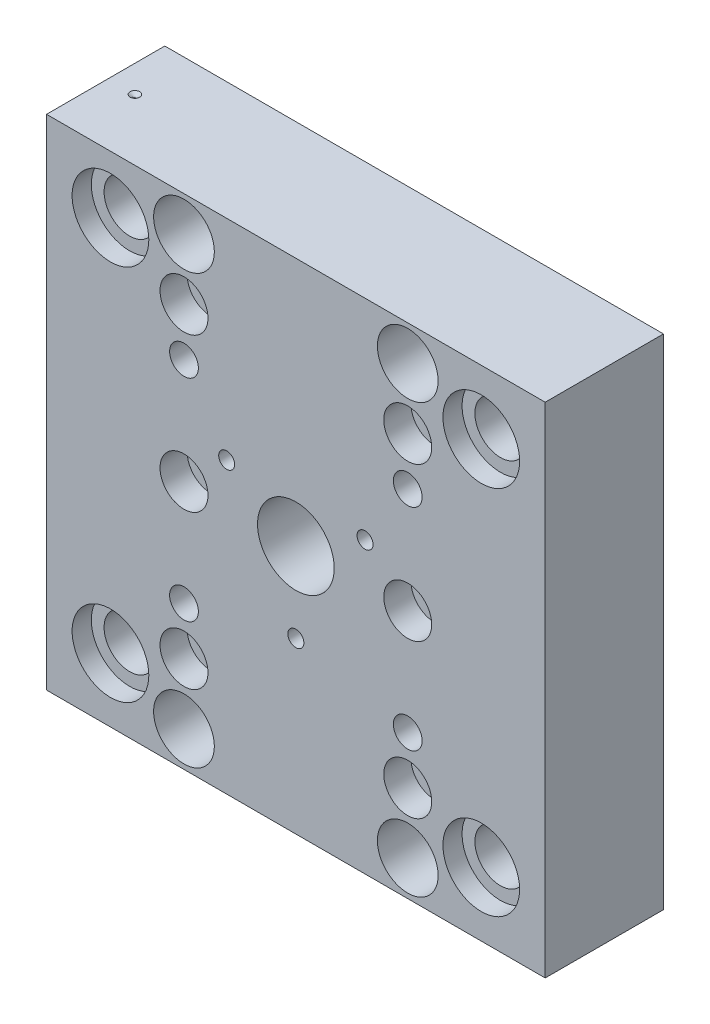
ISO-10303-21;
HEADER;
FILE_DESCRIPTION(('STEP AP214'),'2;1');
FILE_NAME('part.step','',(''),(''),'','','');
FILE_SCHEMA(('AUTOMOTIVE_DESIGN { 1 0 10303 214 1 1 1 1 }'));
ENDSEC;
DATA;
#1=APPLICATION_CONTEXT('core data for automotive mechanical design processes');
#2=APPLICATION_PROTOCOL_DEFINITION('international standard','automotive_design',2000,#1);
#3=PRODUCT_CONTEXT('',#1,'mechanical');
#4=PRODUCT('Part','Part','',(#3));
#5=PRODUCT_RELATED_PRODUCT_CATEGORY('part','',(#4));
#6=PRODUCT_DEFINITION_FORMATION('','',#4);
#7=PRODUCT_DEFINITION_CONTEXT('part definition',#1,'design');
#8=PRODUCT_DEFINITION('design','',#6,#7);
#9=PRODUCT_DEFINITION_SHAPE('','',#8);
#10=(LENGTH_UNIT() NAMED_UNIT(*) SI_UNIT(.MILLI.,.METRE.));
#11=(NAMED_UNIT(*) PLANE_ANGLE_UNIT() SI_UNIT($,.RADIAN.));
#12=(NAMED_UNIT(*) SI_UNIT($,.STERADIAN.) SOLID_ANGLE_UNIT());
#13=UNCERTAINTY_MEASURE_WITH_UNIT(LENGTH_MEASURE(1.E-05),#10,'distance_accuracy_value','');
#14=(GEOMETRIC_REPRESENTATION_CONTEXT(3) GLOBAL_UNCERTAINTY_ASSIGNED_CONTEXT((#13)) GLOBAL_UNIT_ASSIGNED_CONTEXT((#10,
#11,#12)) REPRESENTATION_CONTEXT('',''));
#15=CARTESIAN_POINT('',(0.,0.,0.));
#16=DIRECTION('',(0.,0.,1.));
#17=DIRECTION('',(1.,0.,0.));
#18=AXIS2_PLACEMENT_3D('',#15,#16,#17);
#19=CARTESIAN_POINT('',(-78.,-78.,37.));
#20=DIRECTION('',(0.,0.,1.));
#21=DIRECTION('',(1.,0.,0.));
#22=AXIS2_PLACEMENT_3D('',#19,#20,#21);
#23=PLANE('',#22);
#24=CARTESIAN_POINT('',(21.6506350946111,12.4999999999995,37.));
#25=DIRECTION('',(0.,0.,1.));
#26=DIRECTION('',(1.,0.,0.));
#27=AXIS2_PLACEMENT_3D('',#24,#25,#26);
#28=CIRCLE('',#27,2.5);
#29=CARTESIAN_POINT('',(24.1506350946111,12.4999999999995,37.));
#30=VERTEX_POINT('',#29);
#31=EDGE_CURVE('E106',#30,#30,#28,.T.);
#32=ORIENTED_EDGE('',*,*,#31,.F.);
#33=EDGE_LOOP('',(#32));
#34=FACE_BOUND('',#33,.T.);
#35=CARTESIAN_POINT('',(0.,-25.0000000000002,37.));
#36=DIRECTION('',(0.,0.,1.));
#37=DIRECTION('',(1.,0.,0.));
#38=AXIS2_PLACEMENT_3D('',#35,#36,#37);
#39=CIRCLE('',#38,2.5);
#40=CARTESIAN_POINT('',(2.50000000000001,-25.0000000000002,37.));
#41=VERTEX_POINT('',#40);
#42=EDGE_CURVE('E112',#41,#41,#39,.T.);
#43=ORIENTED_EDGE('',*,*,#42,.F.);
#44=EDGE_LOOP('',(#43));
#45=FACE_BOUND('',#44,.T.);
#46=CARTESIAN_POINT('',(-21.6506350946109,12.4999999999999,37.));
#47=DIRECTION('',(0.,0.,1.));
#48=DIRECTION('',(1.,0.,0.));
#49=AXIS2_PLACEMENT_3D('',#46,#47,#48);
#50=CIRCLE('',#49,2.5);
#51=CARTESIAN_POINT('',(-19.1506350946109,12.4999999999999,37.));
#52=VERTEX_POINT('',#51);
#53=EDGE_CURVE('E118',#52,#52,#50,.T.);
#54=ORIENTED_EDGE('',*,*,#53,.F.);
#55=EDGE_LOOP('',(#54));
#56=FACE_BOUND('',#55,.T.);
#57=CARTESIAN_POINT('',(-35.,-67.,37.));
#58=DIRECTION('',(0.,0.,1.));
#59=DIRECTION('',(1.,0.,0.));
#60=AXIS2_PLACEMENT_3D('',#57,#58,#59);
#61=CIRCLE('',#60,9.5);
#62=CARTESIAN_POINT('',(-25.5,-67.,37.));
#63=VERTEX_POINT('',#62);
#64=EDGE_CURVE('E269',#63,#63,#61,.T.);
#65=ORIENTED_EDGE('',*,*,#64,.F.);
#66=EDGE_LOOP('',(#65));
#67=FACE_BOUND('',#66,.T.);
#68=CARTESIAN_POINT('',(35.,67.,37.));
#69=DIRECTION('',(0.,0.,1.));
#70=DIRECTION('',(1.,0.,0.));
#71=AXIS2_PLACEMENT_3D('',#68,#69,#70);
#72=CIRCLE('',#71,9.5);
#73=CARTESIAN_POINT('',(44.5,67.,37.));
#74=VERTEX_POINT('',#73);
#75=EDGE_CURVE('E281',#74,#74,#72,.T.);
#76=ORIENTED_EDGE('',*,*,#75,.F.);
#77=EDGE_LOOP('',(#76));
#78=FACE_BOUND('',#77,.T.);
#79=DIRECTION('',(0.,-1.,0.));
#80=VECTOR('',#79,1.);
#81=CARTESIAN_POINT('',(-78.,78.,37.));
#82=LINE('',#81,#80);
#83=CARTESIAN_POINT('',(-78.,78.,37.));
#84=VERTEX_POINT('',#83);
#85=CARTESIAN_POINT('',(-78.,-78.,37.));
#86=VERTEX_POINT('',#85);
#87=EDGE_CURVE('E299',#84,#86,#82,.T.);
#88=ORIENTED_EDGE('',*,*,#87,.T.);
#89=DIRECTION('',(1.,0.,0.));
#90=VECTOR('',#89,1.);
#91=CARTESIAN_POINT('',(-78.,-78.,37.));
#92=LINE('',#91,#90);
#93=CARTESIAN_POINT('',(78.,-78.,37.));
#94=VERTEX_POINT('',#93);
#95=EDGE_CURVE('E301',#86,#94,#92,.T.);
#96=ORIENTED_EDGE('',*,*,#95,.T.);
#97=DIRECTION('',(0.,1.,0.));
#98=VECTOR('',#97,1.);
#99=CARTESIAN_POINT('',(78.,-78.,37.));
#100=LINE('',#99,#98);
#101=CARTESIAN_POINT('',(78.,78.,37.));
#102=VERTEX_POINT('',#101);
#103=EDGE_CURVE('E58',#94,#102,#100,.T.);
#104=ORIENTED_EDGE('',*,*,#103,.T.);
#105=DIRECTION('',(-1.,0.,0.));
#106=VECTOR('',#105,1.);
#107=CARTESIAN_POINT('',(78.,78.,37.));
#108=LINE('',#107,#106);
#109=EDGE_CURVE('E53',#102,#84,#108,.T.);
#110=ORIENTED_EDGE('',*,*,#109,.T.);
#111=EDGE_LOOP('',(#88,#96,#104,#110));
#112=FACE_BOUND('',#111,.T.);
#113=CARTESIAN_POINT('',(35.,-67.,37.));
#114=DIRECTION('',(0.,0.,1.));
#115=DIRECTION('',(1.,0.,0.));
#116=AXIS2_PLACEMENT_3D('',#113,#114,#115);
#117=CIRCLE('',#116,9.5);
#118=CARTESIAN_POINT('',(44.5,-67.,37.));
#119=VERTEX_POINT('',#118);
#120=EDGE_CURVE('E287',#119,#119,#117,.T.);
#121=ORIENTED_EDGE('',*,*,#120,.F.);
#122=EDGE_LOOP('',(#121));
#123=FACE_BOUND('',#122,.T.);
#124=CARTESIAN_POINT('',(-35.,67.,37.));
#125=DIRECTION('',(0.,0.,1.));
#126=DIRECTION('',(1.,0.,0.));
#127=AXIS2_PLACEMENT_3D('',#124,#125,#126);
#128=CIRCLE('',#127,9.5);
#129=CARTESIAN_POINT('',(-25.5,67.,37.));
#130=VERTEX_POINT('',#129);
#131=EDGE_CURVE('E275',#130,#130,#128,.T.);
#132=ORIENTED_EDGE('',*,*,#131,.F.);
#133=EDGE_LOOP('',(#132));
#134=FACE_BOUND('',#133,.T.);
#135=CARTESIAN_POINT('',(-35.,48.,37.));
#136=DIRECTION('',(0.,0.,1.));
#137=DIRECTION('',(1.,0.,0.));
#138=AXIS2_PLACEMENT_3D('',#135,#136,#137);
#139=CIRCLE('',#138,7.5);
#140=CARTESIAN_POINT('',(-27.5,48.,37.));
#141=VERTEX_POINT('',#140);
#142=EDGE_CURVE('E260',#141,#141,#139,.T.);
#143=ORIENTED_EDGE('',*,*,#142,.F.);
#144=EDGE_LOOP('',(#143));
#145=FACE_BOUND('',#144,.T.);
#146=CARTESIAN_POINT('',(35.,48.,37.));
#147=DIRECTION('',(0.,0.,1.));
#148=DIRECTION('',(1.,0.,0.));
#149=AXIS2_PLACEMENT_3D('',#146,#147,#148);
#150=CIRCLE('',#149,7.5);
#151=CARTESIAN_POINT('',(42.5,48.,37.));
#152=VERTEX_POINT('',#151);
#153=EDGE_CURVE('E254',#152,#152,#150,.T.);
#154=ORIENTED_EDGE('',*,*,#153,.F.);
#155=EDGE_LOOP('',(#154));
#156=FACE_BOUND('',#155,.T.);
#157=CARTESIAN_POINT('',(-35.,0.,37.));
#158=DIRECTION('',(0.,0.,1.));
#159=DIRECTION('',(1.,0.,0.));
#160=AXIS2_PLACEMENT_3D('',#157,#158,#159);
#161=CIRCLE('',#160,7.5);
#162=CARTESIAN_POINT('',(-27.5,0.,37.));
#163=VERTEX_POINT('',#162);
#164=EDGE_CURVE('E248',#163,#163,#161,.T.);
#165=ORIENTED_EDGE('',*,*,#164,.F.);
#166=EDGE_LOOP('',(#165));
#167=FACE_BOUND('',#166,.T.);
#168=CARTESIAN_POINT('',(35.,0.,37.));
#169=DIRECTION('',(0.,0.,1.));
#170=DIRECTION('',(1.,0.,0.));
#171=AXIS2_PLACEMENT_3D('',#168,#169,#170);
#172=CIRCLE('',#171,7.5);
#173=CARTESIAN_POINT('',(42.5,0.,37.));
#174=VERTEX_POINT('',#173);
#175=EDGE_CURVE('E242',#174,#174,#172,.T.);
#176=ORIENTED_EDGE('',*,*,#175,.F.);
#177=EDGE_LOOP('',(#176));
#178=FACE_BOUND('',#177,.T.);
#179=CARTESIAN_POINT('',(-35.,-48.,37.));
#180=DIRECTION('',(0.,0.,1.));
#181=DIRECTION('',(1.,0.,0.));
#182=AXIS2_PLACEMENT_3D('',#179,#180,#181);
#183=CIRCLE('',#182,7.5);
#184=CARTESIAN_POINT('',(-27.5,-48.,37.));
#185=VERTEX_POINT('',#184);
#186=EDGE_CURVE('E236',#185,#185,#183,.T.);
#187=ORIENTED_EDGE('',*,*,#186,.F.);
#188=EDGE_LOOP('',(#187));
#189=FACE_BOUND('',#188,.T.);
#190=CARTESIAN_POINT('',(35.,-48.,37.));
#191=DIRECTION('',(0.,0.,1.));
#192=DIRECTION('',(1.,0.,0.));
#193=AXIS2_PLACEMENT_3D('',#190,#191,#192);
#194=CIRCLE('',#193,7.5);
#195=CARTESIAN_POINT('',(42.5,-48.,37.));
#196=VERTEX_POINT('',#195);
#197=EDGE_CURVE('E230',#196,#196,#194,.T.);
#198=ORIENTED_EDGE('',*,*,#197,.F.);
#199=EDGE_LOOP('',(#198));
#200=FACE_BOUND('',#199,.T.);
#201=CARTESIAN_POINT('',(-35.,33.,37.));
#202=DIRECTION('',(0.,0.,1.));
#203=DIRECTION('',(1.,0.,0.));
#204=AXIS2_PLACEMENT_3D('',#201,#202,#203);
#205=CIRCLE('',#204,4.5);
#206=CARTESIAN_POINT('',(-30.5,33.,37.));
#207=VERTEX_POINT('',#206);
#208=EDGE_CURVE('E200',#207,#207,#205,.T.);
#209=ORIENTED_EDGE('',*,*,#208,.F.);
#210=EDGE_LOOP('',(#209));
#211=FACE_BOUND('',#210,.T.);
#212=CARTESIAN_POINT('',(35.,33.,37.));
#213=DIRECTION('',(0.,0.,1.));
#214=DIRECTION('',(1.,0.,0.));
#215=AXIS2_PLACEMENT_3D('',#212,#213,#214);
#216=CIRCLE('',#215,4.5);
#217=CARTESIAN_POINT('',(39.5,33.,37.));
#218=VERTEX_POINT('',#217);
#219=EDGE_CURVE('E194',#218,#218,#216,.T.);
#220=ORIENTED_EDGE('',*,*,#219,.F.);
#221=EDGE_LOOP('',(#220));
#222=FACE_BOUND('',#221,.T.);
#223=CARTESIAN_POINT('',(35.,-33.,37.));
#224=DIRECTION('',(0.,0.,1.));
#225=DIRECTION('',(1.,0.,0.));
#226=AXIS2_PLACEMENT_3D('',#223,#224,#225);
#227=CIRCLE('',#226,4.5);
#228=CARTESIAN_POINT('',(39.5,-33.,37.));
#229=VERTEX_POINT('',#228);
#230=EDGE_CURVE('E188',#229,#229,#227,.T.);
#231=ORIENTED_EDGE('',*,*,#230,.F.);
#232=EDGE_LOOP('',(#231));
#233=FACE_BOUND('',#232,.T.);
#234=CARTESIAN_POINT('',(-35.,-33.,37.));
#235=DIRECTION('',(0.,0.,1.));
#236=DIRECTION('',(1.,0.,0.));
#237=AXIS2_PLACEMENT_3D('',#234,#235,#236);
#238=CIRCLE('',#237,4.5);
#239=CARTESIAN_POINT('',(-30.5,-33.,37.));
#240=VERTEX_POINT('',#239);
#241=EDGE_CURVE('E182',#240,#240,#238,.T.);
#242=ORIENTED_EDGE('',*,*,#241,.F.);
#243=EDGE_LOOP('',(#242));
#244=FACE_BOUND('',#243,.T.);
#245=CARTESIAN_POINT('',(-58.,60.,37.));
#246=DIRECTION('',(0.,0.,1.));
#247=DIRECTION('',(1.,0.,0.));
#248=AXIS2_PLACEMENT_3D('',#245,#246,#247);
#249=CIRCLE('',#248,12.);
#250=CARTESIAN_POINT('',(-46.,60.,37.));
#251=VERTEX_POINT('',#250);
#252=EDGE_CURVE('E160',#251,#251,#249,.T.);
#253=ORIENTED_EDGE('',*,*,#252,.F.);
#254=EDGE_LOOP('',(#253));
#255=FACE_BOUND('',#254,.T.);
#256=CARTESIAN_POINT('',(-58.,-58.,37.));
#257=DIRECTION('',(0.,0.,1.));
#258=DIRECTION('',(1.,0.,0.));
#259=AXIS2_PLACEMENT_3D('',#256,#257,#258);
#260=CIRCLE('',#259,12.);
#261=CARTESIAN_POINT('',(-46.,-58.,37.));
#262=VERTEX_POINT('',#261);
#263=EDGE_CURVE('E150',#262,#262,#260,.T.);
#264=ORIENTED_EDGE('',*,*,#263,.F.);
#265=EDGE_LOOP('',(#264));
#266=FACE_BOUND('',#265,.T.);
#267=CARTESIAN_POINT('',(58.,-58.,37.));
#268=DIRECTION('',(0.,0.,1.));
#269=DIRECTION('',(1.,0.,0.));
#270=AXIS2_PLACEMENT_3D('',#267,#268,#269);
#271=CIRCLE('',#270,12.);
#272=CARTESIAN_POINT('',(70.,-58.,37.));
#273=VERTEX_POINT('',#272);
#274=EDGE_CURVE('E140',#273,#273,#271,.T.);
#275=ORIENTED_EDGE('',*,*,#274,.F.);
#276=EDGE_LOOP('',(#275));
#277=FACE_BOUND('',#276,.T.);
#278=CARTESIAN_POINT('',(58.,58.,37.));
#279=DIRECTION('',(0.,0.,1.));
#280=DIRECTION('',(1.,0.,0.));
#281=AXIS2_PLACEMENT_3D('',#278,#279,#280);
#282=CIRCLE('',#281,12.);
#283=CARTESIAN_POINT('',(70.,58.,37.));
#284=VERTEX_POINT('',#283);
#285=EDGE_CURVE('E130',#284,#284,#282,.T.);
#286=ORIENTED_EDGE('',*,*,#285,.F.);
#287=EDGE_LOOP('',(#286));
#288=FACE_BOUND('',#287,.T.);
#289=CARTESIAN_POINT('',(0.,0.,37.));
#290=DIRECTION('',(0.,0.,1.));
#291=DIRECTION('',(1.,0.,0.));
#292=AXIS2_PLACEMENT_3D('',#289,#290,#291);
#293=CIRCLE('',#292,12.);
#294=CARTESIAN_POINT('',(12.,0.,37.));
#295=VERTEX_POINT('',#294);
#296=EDGE_CURVE('E124',#295,#295,#293,.T.);
#297=ORIENTED_EDGE('',*,*,#296,.F.);
#298=EDGE_LOOP('',(#297));
#299=FACE_BOUND('',#298,.T.);
#300=ADVANCED_FACE('F36',(#34,#45,#56,#67,#78,#112,#123,#134,#145,#156,#167,#178,#189,#200,#211,
#222,#233,#244,#255,#266,#277,#288,#299),#23,.T.);
#301=CARTESIAN_POINT('',(-78.,-78.,0.));
#302=DIRECTION('',(0.,0.,1.));
#303=DIRECTION('',(1.,0.,0.));
#304=AXIS2_PLACEMENT_3D('',#301,#302,#303);
#305=PLANE('',#304);
#306=CARTESIAN_POINT('',(-35.,-67.,0.));
#307=DIRECTION('',(0.,0.,1.));
#308=DIRECTION('',(1.,0.,0.));
#309=AXIS2_PLACEMENT_3D('',#306,#307,#308);
#310=CIRCLE('',#309,9.5);
#311=CARTESIAN_POINT('',(-25.5,-67.,0.));
#312=VERTEX_POINT('',#311);
#313=EDGE_CURVE('E266',#312,#312,#310,.T.);
#314=ORIENTED_EDGE('',*,*,#313,.T.);
#315=EDGE_LOOP('',(#314));
#316=FACE_BOUND('',#315,.T.);
#317=CARTESIAN_POINT('',(35.,67.,0.));
#318=DIRECTION('',(0.,0.,1.));
#319=DIRECTION('',(1.,0.,0.));
#320=AXIS2_PLACEMENT_3D('',#317,#318,#319);
#321=CIRCLE('',#320,9.5);
#322=CARTESIAN_POINT('',(44.5,67.,0.));
#323=VERTEX_POINT('',#322);
#324=EDGE_CURVE('E278',#323,#323,#321,.T.);
#325=ORIENTED_EDGE('',*,*,#324,.T.);
#326=EDGE_LOOP('',(#325));
#327=FACE_BOUND('',#326,.T.);
#328=DIRECTION('',(0.,-1.,0.));
#329=VECTOR('',#328,1.);
#330=CARTESIAN_POINT('',(-78.,78.,0.));
#331=LINE('',#330,#329);
#332=CARTESIAN_POINT('',(-78.,78.,0.));
#333=VERTEX_POINT('',#332);
#334=CARTESIAN_POINT('',(-78.,-78.,0.));
#335=VERTEX_POINT('',#334);
#336=EDGE_CURVE('E290',#333,#335,#331,.T.);
#337=ORIENTED_EDGE('',*,*,#336,.F.);
#338=DIRECTION('',(-1.,0.,0.));
#339=VECTOR('',#338,1.);
#340=CARTESIAN_POINT('',(78.,78.,0.));
#341=LINE('',#340,#339);
#342=CARTESIAN_POINT('',(78.,78.,0.));
#343=VERTEX_POINT('',#342);
#344=EDGE_CURVE('E297',#343,#333,#341,.T.);
#345=ORIENTED_EDGE('',*,*,#344,.F.);
#346=DIRECTION('',(0.,1.,0.));
#347=VECTOR('',#346,1.);
#348=CARTESIAN_POINT('',(78.,-78.,0.));
#349=LINE('',#348,#347);
#350=CARTESIAN_POINT('',(78.,-78.,0.));
#351=VERTEX_POINT('',#350);
#352=EDGE_CURVE('E295',#351,#343,#349,.T.);
#353=ORIENTED_EDGE('',*,*,#352,.F.);
#354=DIRECTION('',(1.,0.,0.));
#355=VECTOR('',#354,1.);
#356=CARTESIAN_POINT('',(-78.,-78.,0.));
#357=LINE('',#356,#355);
#358=EDGE_CURVE('E293',#335,#351,#357,.T.);
#359=ORIENTED_EDGE('',*,*,#358,.F.);
#360=EDGE_LOOP('',(#337,#345,#353,#359));
#361=FACE_BOUND('',#360,.T.);
#362=CARTESIAN_POINT('',(35.,-67.,0.));
#363=DIRECTION('',(0.,0.,1.));
#364=DIRECTION('',(1.,0.,0.));
#365=AXIS2_PLACEMENT_3D('',#362,#363,#364);
#366=CIRCLE('',#365,9.5);
#367=CARTESIAN_POINT('',(44.5,-67.,0.));
#368=VERTEX_POINT('',#367);
#369=EDGE_CURVE('E284',#368,#368,#366,.T.);
#370=ORIENTED_EDGE('',*,*,#369,.T.);
#371=EDGE_LOOP('',(#370));
#372=FACE_BOUND('',#371,.T.);
#373=CARTESIAN_POINT('',(-35.,67.,0.));
#374=DIRECTION('',(0.,0.,1.));
#375=DIRECTION('',(1.,0.,0.));
#376=AXIS2_PLACEMENT_3D('',#373,#374,#375);
#377=CIRCLE('',#376,9.5);
#378=CARTESIAN_POINT('',(-25.5,67.,0.));
#379=VERTEX_POINT('',#378);
#380=EDGE_CURVE('E272',#379,#379,#377,.T.);
#381=ORIENTED_EDGE('',*,*,#380,.T.);
#382=EDGE_LOOP('',(#381));
#383=FACE_BOUND('',#382,.T.);
#384=CARTESIAN_POINT('',(35.,-48.,0.));
#385=DIRECTION('',(0.,0.,1.));
#386=DIRECTION('',(1.,0.,0.));
#387=AXIS2_PLACEMENT_3D('',#384,#385,#386);
#388=CIRCLE('',#387,4.5);
#389=CARTESIAN_POINT('',(39.5,-48.,0.));
#390=VERTEX_POINT('',#389);
#391=EDGE_CURVE('E226',#390,#390,#388,.T.);
#392=ORIENTED_EDGE('',*,*,#391,.T.);
#393=EDGE_LOOP('',(#392));
#394=FACE_BOUND('',#393,.T.);
#395=CARTESIAN_POINT('',(-35.,-48.,0.));
#396=DIRECTION('',(0.,0.,1.));
#397=DIRECTION('',(1.,0.,0.));
#398=AXIS2_PLACEMENT_3D('',#395,#396,#397);
#399=CIRCLE('',#398,4.5);
#400=CARTESIAN_POINT('',(-30.5,-48.,0.));
#401=VERTEX_POINT('',#400);
#402=EDGE_CURVE('E222',#401,#401,#399,.T.);
#403=ORIENTED_EDGE('',*,*,#402,.T.);
#404=EDGE_LOOP('',(#403));
#405=FACE_BOUND('',#404,.T.);
#406=CARTESIAN_POINT('',(35.,0.,0.));
#407=DIRECTION('',(0.,0.,1.));
#408=DIRECTION('',(1.,0.,0.));
#409=AXIS2_PLACEMENT_3D('',#406,#407,#408);
#410=CIRCLE('',#409,4.5);
#411=CARTESIAN_POINT('',(39.5,0.,0.));
#412=VERTEX_POINT('',#411);
#413=EDGE_CURVE('E218',#412,#412,#410,.T.);
#414=ORIENTED_EDGE('',*,*,#413,.T.);
#415=EDGE_LOOP('',(#414));
#416=FACE_BOUND('',#415,.T.);
#417=CARTESIAN_POINT('',(-35.,0.,0.));
#418=DIRECTION('',(0.,0.,1.));
#419=DIRECTION('',(1.,0.,0.));
#420=AXIS2_PLACEMENT_3D('',#417,#418,#419);
#421=CIRCLE('',#420,4.5);
#422=CARTESIAN_POINT('',(-30.5,0.,0.));
#423=VERTEX_POINT('',#422);
#424=EDGE_CURVE('E214',#423,#423,#421,.T.);
#425=ORIENTED_EDGE('',*,*,#424,.T.);
#426=EDGE_LOOP('',(#425));
#427=FACE_BOUND('',#426,.T.);
#428=CARTESIAN_POINT('',(-35.,48.,0.));
#429=DIRECTION('',(0.,0.,1.));
#430=DIRECTION('',(1.,0.,0.));
#431=AXIS2_PLACEMENT_3D('',#428,#429,#430);
#432=CIRCLE('',#431,4.5);
#433=CARTESIAN_POINT('',(-30.5,48.,0.));
#434=VERTEX_POINT('',#433);
#435=EDGE_CURVE('E210',#434,#434,#432,.T.);
#436=ORIENTED_EDGE('',*,*,#435,.T.);
#437=EDGE_LOOP('',(#436));
#438=FACE_BOUND('',#437,.T.);
#439=CARTESIAN_POINT('',(35.,48.,0.));
#440=DIRECTION('',(0.,0.,1.));
#441=DIRECTION('',(1.,0.,0.));
#442=AXIS2_PLACEMENT_3D('',#439,#440,#441);
#443=CIRCLE('',#442,4.5);
#444=CARTESIAN_POINT('',(39.5,48.,0.));
#445=VERTEX_POINT('',#444);
#446=EDGE_CURVE('E206',#445,#445,#443,.T.);
#447=ORIENTED_EDGE('',*,*,#446,.T.);
#448=EDGE_LOOP('',(#447));
#449=FACE_BOUND('',#448,.T.);
#450=CARTESIAN_POINT('',(-35.,-33.,0.));
#451=DIRECTION('',(0.,0.,1.));
#452=DIRECTION('',(1.,0.,0.));
#453=AXIS2_PLACEMENT_3D('',#450,#451,#452);
#454=CIRCLE('',#453,4.);
#455=CARTESIAN_POINT('',(-31.,-33.,0.));
#456=VERTEX_POINT('',#455);
#457=EDGE_CURVE('E178',#456,#456,#454,.T.);
#458=ORIENTED_EDGE('',*,*,#457,.T.);
#459=EDGE_LOOP('',(#458));
#460=FACE_BOUND('',#459,.T.);
#461=CARTESIAN_POINT('',(35.,-33.,0.));
#462=DIRECTION('',(0.,0.,1.));
#463=DIRECTION('',(1.,0.,0.));
#464=AXIS2_PLACEMENT_3D('',#461,#462,#463);
#465=CIRCLE('',#464,4.);
#466=CARTESIAN_POINT('',(39.,-33.,0.));
#467=VERTEX_POINT('',#466);
#468=EDGE_CURVE('E174',#467,#467,#465,.T.);
#469=ORIENTED_EDGE('',*,*,#468,.T.);
#470=EDGE_LOOP('',(#469));
#471=FACE_BOUND('',#470,.T.);
#472=CARTESIAN_POINT('',(35.,33.,0.));
#473=DIRECTION('',(0.,0.,1.));
#474=DIRECTION('',(1.,0.,0.));
#475=AXIS2_PLACEMENT_3D('',#472,#473,#474);
#476=CIRCLE('',#475,4.);
#477=CARTESIAN_POINT('',(39.,33.,0.));
#478=VERTEX_POINT('',#477);
#479=EDGE_CURVE('E170',#478,#478,#476,.T.);
#480=ORIENTED_EDGE('',*,*,#479,.T.);
#481=EDGE_LOOP('',(#480));
#482=FACE_BOUND('',#481,.T.);
#483=CARTESIAN_POINT('',(-35.,33.,0.));
#484=DIRECTION('',(0.,0.,1.));
#485=DIRECTION('',(1.,0.,0.));
#486=AXIS2_PLACEMENT_3D('',#483,#484,#485);
#487=CIRCLE('',#486,4.);
#488=CARTESIAN_POINT('',(-31.,33.,0.));
#489=VERTEX_POINT('',#488);
#490=EDGE_CURVE('E166',#489,#489,#487,.T.);
#491=ORIENTED_EDGE('',*,*,#490,.T.);
#492=EDGE_LOOP('',(#491));
#493=FACE_BOUND('',#492,.T.);
#494=CARTESIAN_POINT('',(-58.,60.,0.));
#495=DIRECTION('',(0.,0.,1.));
#496=DIRECTION('',(1.,0.,0.));
#497=AXIS2_PLACEMENT_3D('',#494,#495,#496);
#498=CIRCLE('',#497,8.);
#499=CARTESIAN_POINT('',(-50.,60.,0.));
#500=VERTEX_POINT('',#499);
#501=EDGE_CURVE('E156',#500,#500,#498,.T.);
#502=ORIENTED_EDGE('',*,*,#501,.T.);
#503=EDGE_LOOP('',(#502));
#504=FACE_BOUND('',#503,.T.);
#505=CARTESIAN_POINT('',(-58.,-58.,0.));
#506=DIRECTION('',(0.,0.,1.));
#507=DIRECTION('',(1.,0.,0.));
#508=AXIS2_PLACEMENT_3D('',#505,#506,#507);
#509=CIRCLE('',#508,8.);
#510=CARTESIAN_POINT('',(-50.,-58.,0.));
#511=VERTEX_POINT('',#510);
#512=EDGE_CURVE('E146',#511,#511,#509,.T.);
#513=ORIENTED_EDGE('',*,*,#512,.T.);
#514=EDGE_LOOP('',(#513));
#515=FACE_BOUND('',#514,.T.);
#516=CARTESIAN_POINT('',(58.,-58.,0.));
#517=DIRECTION('',(0.,0.,1.));
#518=DIRECTION('',(1.,0.,0.));
#519=AXIS2_PLACEMENT_3D('',#516,#517,#518);
#520=CIRCLE('',#519,8.);
#521=CARTESIAN_POINT('',(66.,-58.,0.));
#522=VERTEX_POINT('',#521);
#523=EDGE_CURVE('E136',#522,#522,#520,.T.);
#524=ORIENTED_EDGE('',*,*,#523,.T.);
#525=EDGE_LOOP('',(#524));
#526=FACE_BOUND('',#525,.T.);
#527=CARTESIAN_POINT('',(58.,58.,0.));
#528=DIRECTION('',(0.,0.,1.));
#529=DIRECTION('',(1.,0.,0.));
#530=AXIS2_PLACEMENT_3D('',#527,#528,#529);
#531=CIRCLE('',#530,8.);
#532=CARTESIAN_POINT('',(66.,58.,0.));
#533=VERTEX_POINT('',#532);
#534=EDGE_CURVE('E127',#533,#533,#531,.T.);
#535=ORIENTED_EDGE('',*,*,#534,.T.);
#536=EDGE_LOOP('',(#535));
#537=FACE_BOUND('',#536,.T.);
#538=CARTESIAN_POINT('',(0.,0.,0.));
#539=DIRECTION('',(0.,0.,1.));
#540=DIRECTION('',(1.,0.,0.));
#541=AXIS2_PLACEMENT_3D('',#538,#539,#540);
#542=CIRCLE('',#541,12.);
#543=CARTESIAN_POINT('',(12.,0.,0.));
#544=VERTEX_POINT('',#543);
#545=EDGE_CURVE('E121',#544,#544,#542,.T.);
#546=ORIENTED_EDGE('',*,*,#545,.T.);
#547=EDGE_LOOP('',(#546));
#548=FACE_BOUND('',#547,.T.);
#549=ADVANCED_FACE('F357',(#316,#327,#361,#372,#383,#394,#405,#416,#427,#438,#449,#460,#471,
#482,#493,#504,#515,#526,#537,#548),#305,.F.);
#550=CARTESIAN_POINT('',(-78.,78.,37.));
#551=DIRECTION('',(1.,0.,0.));
#552=DIRECTION('',(0.,0.,-1.));
#553=AXIS2_PLACEMENT_3D('',#550,#551,#552);
#554=PLANE('',#553);
#555=ORIENTED_EDGE('',*,*,#336,.T.);
#556=DIRECTION('',(0.,0.,-1.));
#557=VECTOR('',#556,1.);
#558=CARTESIAN_POINT('',(-78.,-78.,37.));
#559=LINE('',#558,#557);
#560=EDGE_CURVE('E11',#86,#335,#559,.T.);
#561=ORIENTED_EDGE('',*,*,#560,.F.);
#562=ORIENTED_EDGE('',*,*,#87,.F.);
#563=DIRECTION('',(0.,0.,-1.));
#564=VECTOR('',#563,1.);
#565=CARTESIAN_POINT('',(-78.,78.,37.));
#566=LINE('',#565,#564);
#567=EDGE_CURVE('E305',#84,#333,#566,.T.);
#568=ORIENTED_EDGE('',*,*,#567,.T.);
#569=EDGE_LOOP('',(#555,#561,#562,#568));
#570=FACE_BOUND('',#569,.T.);
#571=ADVANCED_FACE('F38',(#570),#554,.F.);
#572=CARTESIAN_POINT('',(-78.,-78.,37.));
#573=DIRECTION('',(0.,1.,0.));
#574=DIRECTION('',(0.,0.,1.));
#575=AXIS2_PLACEMENT_3D('',#572,#573,#574);
#576=PLANE('',#575);
#577=ORIENTED_EDGE('',*,*,#358,.T.);
#578=DIRECTION('',(0.,0.,-1.));
#579=VECTOR('',#578,1.);
#580=CARTESIAN_POINT('',(78.,-78.,37.));
#581=LINE('',#580,#579);
#582=EDGE_CURVE('E45',#94,#351,#581,.T.);
#583=ORIENTED_EDGE('',*,*,#582,.F.);
#584=ORIENTED_EDGE('',*,*,#95,.F.);
#585=ORIENTED_EDGE('',*,*,#560,.T.);
#586=EDGE_LOOP('',(#577,#583,#584,#585));
#587=FACE_BOUND('',#586,.T.);
#588=ADVANCED_FACE('F378',(#587),#576,.F.);
#589=CARTESIAN_POINT('',(78.,-78.,37.));
#590=DIRECTION('',(-1.,0.,0.));
#591=DIRECTION('',(0.,0.,1.));
#592=AXIS2_PLACEMENT_3D('',#589,#590,#591);
#593=PLANE('',#592);
#594=ORIENTED_EDGE('',*,*,#352,.T.);
#595=DIRECTION('',(0.,0.,-1.));
#596=VECTOR('',#595,1.);
#597=CARTESIAN_POINT('',(78.,78.,37.));
#598=LINE('',#597,#596);
#599=EDGE_CURVE('E308',#102,#343,#598,.T.);
#600=ORIENTED_EDGE('',*,*,#599,.F.);
#601=ORIENTED_EDGE('',*,*,#103,.F.);
#602=ORIENTED_EDGE('',*,*,#582,.T.);
#603=EDGE_LOOP('',(#594,#600,#601,#602));
#604=FACE_BOUND('',#603,.T.);
#605=ADVANCED_FACE('F388',(#604),#593,.F.);
#606=CARTESIAN_POINT('',(78.,78.,37.));
#607=DIRECTION('',(0.,-1.,0.));
#608=DIRECTION('',(0.,0.,-1.));
#609=AXIS2_PLACEMENT_3D('',#606,#607,#608);
#610=PLANE('',#609);
#611=CARTESIAN_POINT('',(-69.5562761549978,78.,17.7979461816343));
#612=DIRECTION('',(0.,1.,0.));
#613=DIRECTION('',(0.,0.,1.));
#614=AXIS2_PLACEMENT_3D('',#611,#612,#613);
#615=CIRCLE('',#614,1.5);
#616=CARTESIAN_POINT('',(-69.5562761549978,78.,19.2979461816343));
#617=VERTEX_POINT('',#616);
#618=EDGE_CURVE('E98',#617,#617,#615,.T.);
#619=ORIENTED_EDGE('',*,*,#618,.F.);
#620=EDGE_LOOP('',(#619));
#621=FACE_BOUND('',#620,.T.);
#622=ORIENTED_EDGE('',*,*,#344,.T.);
#623=ORIENTED_EDGE('',*,*,#567,.F.);
#624=ORIENTED_EDGE('',*,*,#109,.F.);
#625=ORIENTED_EDGE('',*,*,#599,.T.);
#626=EDGE_LOOP('',(#622,#623,#624,#625));
#627=FACE_BOUND('',#626,.T.);
#628=ADVANCED_FACE('F385',(#621,#627),#610,.F.);
#629=CARTESIAN_POINT('',(35.,-67.,37.));
#630=DIRECTION('',(0.,0.,-1.));
#631=DIRECTION('',(-1.,0.,0.));
#632=AXIS2_PLACEMENT_3D('',#629,#630,#631);
#633=CYLINDRICAL_SURFACE('',#632,9.5);
#634=ORIENTED_EDGE('',*,*,#120,.T.);
#635=EDGE_LOOP('',(#634));
#636=FACE_BOUND('',#635,.T.);
#637=ORIENTED_EDGE('',*,*,#369,.F.);
#638=EDGE_LOOP('',(#637));
#639=FACE_BOUND('',#638,.T.);
#640=ADVANCED_FACE('F382',(#636,#639),#633,.F.);
#641=CARTESIAN_POINT('',(35.,67.,37.));
#642=DIRECTION('',(0.,0.,-1.));
#643=DIRECTION('',(-1.,0.,0.));
#644=AXIS2_PLACEMENT_3D('',#641,#642,#643);
#645=CYLINDRICAL_SURFACE('',#644,9.5);
#646=ORIENTED_EDGE('',*,*,#75,.T.);
#647=EDGE_LOOP('',(#646));
#648=FACE_BOUND('',#647,.T.);
#649=ORIENTED_EDGE('',*,*,#324,.F.);
#650=EDGE_LOOP('',(#649));
#651=FACE_BOUND('',#650,.T.);
#652=ADVANCED_FACE('F585',(#648,#651),#645,.F.);
#653=CARTESIAN_POINT('',(-35.,67.,37.));
#654=DIRECTION('',(0.,0.,-1.));
#655=DIRECTION('',(-1.,0.,0.));
#656=AXIS2_PLACEMENT_3D('',#653,#654,#655);
#657=CYLINDRICAL_SURFACE('',#656,9.5);
#658=ORIENTED_EDGE('',*,*,#131,.T.);
#659=EDGE_LOOP('',(#658));
#660=FACE_BOUND('',#659,.T.);
#661=ORIENTED_EDGE('',*,*,#380,.F.);
#662=EDGE_LOOP('',(#661));
#663=FACE_BOUND('',#662,.T.);
#664=ADVANCED_FACE('F582',(#660,#663),#657,.F.);
#665=CARTESIAN_POINT('',(-35.,-67.,37.));
#666=DIRECTION('',(0.,0.,-1.));
#667=DIRECTION('',(-1.,0.,0.));
#668=AXIS2_PLACEMENT_3D('',#665,#666,#667);
#669=CYLINDRICAL_SURFACE('',#668,9.5);
#670=ORIENTED_EDGE('',*,*,#64,.T.);
#671=EDGE_LOOP('',(#670));
#672=FACE_BOUND('',#671,.T.);
#673=ORIENTED_EDGE('',*,*,#313,.F.);
#674=EDGE_LOOP('',(#673));
#675=FACE_BOUND('',#674,.T.);
#676=ADVANCED_FACE('F578',(#672,#675),#669,.F.);
#677=CARTESIAN_POINT('',(-35.,48.,28.5));
#678=DIRECTION('',(0.,0.,1.));
#679=DIRECTION('',(1.,0.,0.));
#680=AXIS2_PLACEMENT_3D('',#677,#678,#679);
#681=CYLINDRICAL_SURFACE('',#680,7.5);
#682=CARTESIAN_POINT('',(-35.,48.,28.5));
#683=DIRECTION('',(0.,0.,1.));
#684=DIRECTION('',(1.,0.,0.));
#685=AXIS2_PLACEMENT_3D('',#682,#683,#684);
#686=CIRCLE('',#685,7.5);
#687=CARTESIAN_POINT('',(-27.5,48.,28.5));
#688=VERTEX_POINT('',#687);
#689=EDGE_CURVE('E263',#688,#688,#686,.T.);
#690=ORIENTED_EDGE('',*,*,#689,.F.);
#691=EDGE_LOOP('',(#690));
#692=FACE_BOUND('',#691,.T.);
#693=ORIENTED_EDGE('',*,*,#142,.T.);
#694=EDGE_LOOP('',(#693));
#695=FACE_BOUND('',#694,.T.);
#696=ADVANCED_FACE('F574',(#692,#695),#681,.F.);
#697=CARTESIAN_POINT('',(-35.,48.,28.5));
#698=DIRECTION('',(0.,0.,1.));
#699=DIRECTION('',(1.,0.,0.));
#700=AXIS2_PLACEMENT_3D('',#697,#698,#699);
#701=PLANE('',#700);
#702=CARTESIAN_POINT('',(-35.,48.,28.5));
#703=DIRECTION('',(0.,0.,1.));
#704=DIRECTION('',(1.,0.,0.));
#705=AXIS2_PLACEMENT_3D('',#702,#703,#704);
#706=CIRCLE('',#705,4.5);
#707=CARTESIAN_POINT('',(-30.5,48.,28.5));
#708=VERTEX_POINT('',#707);
#709=EDGE_CURVE('E213',#708,#708,#706,.T.);
#710=ORIENTED_EDGE('',*,*,#709,.F.);
#711=EDGE_LOOP('',(#710));
#712=FACE_BOUND('',#711,.T.);
#713=ORIENTED_EDGE('',*,*,#689,.T.);
#714=EDGE_LOOP('',(#713));
#715=FACE_BOUND('',#714,.T.);
#716=ADVANCED_FACE('F570',(#712,#715),#701,.T.);
#717=CARTESIAN_POINT('',(35.,48.,28.5));
#718=DIRECTION('',(0.,0.,1.));
#719=DIRECTION('',(1.,0.,0.));
#720=AXIS2_PLACEMENT_3D('',#717,#718,#719);
#721=CYLINDRICAL_SURFACE('',#720,7.5);
#722=CARTESIAN_POINT('',(35.,48.,28.5));
#723=DIRECTION('',(0.,0.,1.));
#724=DIRECTION('',(1.,0.,0.));
#725=AXIS2_PLACEMENT_3D('',#722,#723,#724);
#726=CIRCLE('',#725,7.5);
#727=CARTESIAN_POINT('',(42.5,48.,28.5));
#728=VERTEX_POINT('',#727);
#729=EDGE_CURVE('E257',#728,#728,#726,.T.);
#730=ORIENTED_EDGE('',*,*,#729,.F.);
#731=EDGE_LOOP('',(#730));
#732=FACE_BOUND('',#731,.T.);
#733=ORIENTED_EDGE('',*,*,#153,.T.);
#734=EDGE_LOOP('',(#733));
#735=FACE_BOUND('',#734,.T.);
#736=ADVANCED_FACE('F566',(#732,#735),#721,.F.);
#737=CARTESIAN_POINT('',(35.,48.,28.5));
#738=DIRECTION('',(0.,0.,1.));
#739=DIRECTION('',(1.,0.,0.));
#740=AXIS2_PLACEMENT_3D('',#737,#738,#739);
#741=PLANE('',#740);
#742=CARTESIAN_POINT('',(35.,48.,28.5));
#743=DIRECTION('',(0.,0.,1.));
#744=DIRECTION('',(1.,0.,0.));
#745=AXIS2_PLACEMENT_3D('',#742,#743,#744);
#746=CIRCLE('',#745,4.5);
#747=CARTESIAN_POINT('',(39.5,48.,28.5));
#748=VERTEX_POINT('',#747);
#749=EDGE_CURVE('E209',#748,#748,#746,.T.);
#750=ORIENTED_EDGE('',*,*,#749,.F.);
#751=EDGE_LOOP('',(#750));
#752=FACE_BOUND('',#751,.T.);
#753=ORIENTED_EDGE('',*,*,#729,.T.);
#754=EDGE_LOOP('',(#753));
#755=FACE_BOUND('',#754,.T.);
#756=ADVANCED_FACE('F562',(#752,#755),#741,.T.);
#757=CARTESIAN_POINT('',(-35.,0.,28.5));
#758=DIRECTION('',(0.,0.,1.));
#759=DIRECTION('',(1.,0.,0.));
#760=AXIS2_PLACEMENT_3D('',#757,#758,#759);
#761=CYLINDRICAL_SURFACE('',#760,7.5);
#762=CARTESIAN_POINT('',(-35.,0.,28.5));
#763=DIRECTION('',(0.,0.,1.));
#764=DIRECTION('',(1.,0.,0.));
#765=AXIS2_PLACEMENT_3D('',#762,#763,#764);
#766=CIRCLE('',#765,7.5);
#767=CARTESIAN_POINT('',(-27.5,0.,28.5));
#768=VERTEX_POINT('',#767);
#769=EDGE_CURVE('E251',#768,#768,#766,.T.);
#770=ORIENTED_EDGE('',*,*,#769,.F.);
#771=EDGE_LOOP('',(#770));
#772=FACE_BOUND('',#771,.T.);
#773=ORIENTED_EDGE('',*,*,#164,.T.);
#774=EDGE_LOOP('',(#773));
#775=FACE_BOUND('',#774,.T.);
#776=ADVANCED_FACE('F558',(#772,#775),#761,.F.);
#777=CARTESIAN_POINT('',(-35.,0.,28.5));
#778=DIRECTION('',(0.,0.,1.));
#779=DIRECTION('',(1.,0.,0.));
#780=AXIS2_PLACEMENT_3D('',#777,#778,#779);
#781=PLANE('',#780);
#782=CARTESIAN_POINT('',(-35.,0.,28.5));
#783=DIRECTION('',(0.,0.,1.));
#784=DIRECTION('',(1.,0.,0.));
#785=AXIS2_PLACEMENT_3D('',#782,#783,#784);
#786=CIRCLE('',#785,4.5);
#787=CARTESIAN_POINT('',(-30.5,0.,28.5));
#788=VERTEX_POINT('',#787);
#789=EDGE_CURVE('E217',#788,#788,#786,.T.);
#790=ORIENTED_EDGE('',*,*,#789,.F.);
#791=EDGE_LOOP('',(#790));
#792=FACE_BOUND('',#791,.T.);
#793=ORIENTED_EDGE('',*,*,#769,.T.);
#794=EDGE_LOOP('',(#793));
#795=FACE_BOUND('',#794,.T.);
#796=ADVANCED_FACE('F554',(#792,#795),#781,.T.);
#797=CARTESIAN_POINT('',(35.,0.,28.5));
#798=DIRECTION('',(0.,0.,1.));
#799=DIRECTION('',(1.,0.,0.));
#800=AXIS2_PLACEMENT_3D('',#797,#798,#799);
#801=CYLINDRICAL_SURFACE('',#800,7.5);
#802=CARTESIAN_POINT('',(35.,0.,28.5));
#803=DIRECTION('',(0.,0.,1.));
#804=DIRECTION('',(1.,0.,0.));
#805=AXIS2_PLACEMENT_3D('',#802,#803,#804);
#806=CIRCLE('',#805,7.5);
#807=CARTESIAN_POINT('',(42.5,0.,28.5));
#808=VERTEX_POINT('',#807);
#809=EDGE_CURVE('E245',#808,#808,#806,.T.);
#810=ORIENTED_EDGE('',*,*,#809,.F.);
#811=EDGE_LOOP('',(#810));
#812=FACE_BOUND('',#811,.T.);
#813=ORIENTED_EDGE('',*,*,#175,.T.);
#814=EDGE_LOOP('',(#813));
#815=FACE_BOUND('',#814,.T.);
#816=ADVANCED_FACE('F550',(#812,#815),#801,.F.);
#817=CARTESIAN_POINT('',(35.,0.,28.5));
#818=DIRECTION('',(0.,0.,1.));
#819=DIRECTION('',(1.,0.,0.));
#820=AXIS2_PLACEMENT_3D('',#817,#818,#819);
#821=PLANE('',#820);
#822=CARTESIAN_POINT('',(35.,0.,28.5));
#823=DIRECTION('',(0.,0.,1.));
#824=DIRECTION('',(1.,0.,0.));
#825=AXIS2_PLACEMENT_3D('',#822,#823,#824);
#826=CIRCLE('',#825,4.5);
#827=CARTESIAN_POINT('',(39.5,0.,28.5));
#828=VERTEX_POINT('',#827);
#829=EDGE_CURVE('E221',#828,#828,#826,.T.);
#830=ORIENTED_EDGE('',*,*,#829,.F.);
#831=EDGE_LOOP('',(#830));
#832=FACE_BOUND('',#831,.T.);
#833=ORIENTED_EDGE('',*,*,#809,.T.);
#834=EDGE_LOOP('',(#833));
#835=FACE_BOUND('',#834,.T.);
#836=ADVANCED_FACE('F546',(#832,#835),#821,.T.);
#837=CARTESIAN_POINT('',(-35.,-48.,28.5));
#838=DIRECTION('',(0.,0.,1.));
#839=DIRECTION('',(1.,0.,0.));
#840=AXIS2_PLACEMENT_3D('',#837,#838,#839);
#841=CYLINDRICAL_SURFACE('',#840,7.5);
#842=CARTESIAN_POINT('',(-35.,-48.,28.5));
#843=DIRECTION('',(0.,0.,1.));
#844=DIRECTION('',(1.,0.,0.));
#845=AXIS2_PLACEMENT_3D('',#842,#843,#844);
#846=CIRCLE('',#845,7.5);
#847=CARTESIAN_POINT('',(-27.5,-48.,28.5));
#848=VERTEX_POINT('',#847);
#849=EDGE_CURVE('E239',#848,#848,#846,.T.);
#850=ORIENTED_EDGE('',*,*,#849,.F.);
#851=EDGE_LOOP('',(#850));
#852=FACE_BOUND('',#851,.T.);
#853=ORIENTED_EDGE('',*,*,#186,.T.);
#854=EDGE_LOOP('',(#853));
#855=FACE_BOUND('',#854,.T.);
#856=ADVANCED_FACE('F542',(#852,#855),#841,.F.);
#857=CARTESIAN_POINT('',(-35.,-48.,28.5));
#858=DIRECTION('',(0.,0.,1.));
#859=DIRECTION('',(1.,0.,0.));
#860=AXIS2_PLACEMENT_3D('',#857,#858,#859);
#861=PLANE('',#860);
#862=CARTESIAN_POINT('',(-35.,-48.,28.5));
#863=DIRECTION('',(0.,0.,1.));
#864=DIRECTION('',(1.,0.,0.));
#865=AXIS2_PLACEMENT_3D('',#862,#863,#864);
#866=CIRCLE('',#865,4.5);
#867=CARTESIAN_POINT('',(-30.5,-48.,28.5));
#868=VERTEX_POINT('',#867);
#869=EDGE_CURVE('E225',#868,#868,#866,.T.);
#870=ORIENTED_EDGE('',*,*,#869,.F.);
#871=EDGE_LOOP('',(#870));
#872=FACE_BOUND('',#871,.T.);
#873=ORIENTED_EDGE('',*,*,#849,.T.);
#874=EDGE_LOOP('',(#873));
#875=FACE_BOUND('',#874,.T.);
#876=ADVANCED_FACE('F538',(#872,#875),#861,.T.);
#877=CARTESIAN_POINT('',(35.,-48.,28.5));
#878=DIRECTION('',(0.,0.,1.));
#879=DIRECTION('',(1.,0.,0.));
#880=AXIS2_PLACEMENT_3D('',#877,#878,#879);
#881=CYLINDRICAL_SURFACE('',#880,7.5);
#882=CARTESIAN_POINT('',(35.,-48.,28.5));
#883=DIRECTION('',(0.,0.,1.));
#884=DIRECTION('',(1.,0.,0.));
#885=AXIS2_PLACEMENT_3D('',#882,#883,#884);
#886=CIRCLE('',#885,7.5);
#887=CARTESIAN_POINT('',(42.5,-48.,28.5));
#888=VERTEX_POINT('',#887);
#889=EDGE_CURVE('E233',#888,#888,#886,.T.);
#890=ORIENTED_EDGE('',*,*,#889,.F.);
#891=EDGE_LOOP('',(#890));
#892=FACE_BOUND('',#891,.T.);
#893=ORIENTED_EDGE('',*,*,#197,.T.);
#894=EDGE_LOOP('',(#893));
#895=FACE_BOUND('',#894,.T.);
#896=ADVANCED_FACE('F534',(#892,#895),#881,.F.);
#897=CARTESIAN_POINT('',(35.,-48.,28.5));
#898=DIRECTION('',(0.,0.,1.));
#899=DIRECTION('',(1.,0.,0.));
#900=AXIS2_PLACEMENT_3D('',#897,#898,#899);
#901=PLANE('',#900);
#902=CARTESIAN_POINT('',(35.,-48.,28.5));
#903=DIRECTION('',(0.,0.,1.));
#904=DIRECTION('',(1.,0.,0.));
#905=AXIS2_PLACEMENT_3D('',#902,#903,#904);
#906=CIRCLE('',#905,4.5);
#907=CARTESIAN_POINT('',(39.5,-48.,28.5));
#908=VERTEX_POINT('',#907);
#909=EDGE_CURVE('E229',#908,#908,#906,.T.);
#910=ORIENTED_EDGE('',*,*,#909,.F.);
#911=EDGE_LOOP('',(#910));
#912=FACE_BOUND('',#911,.T.);
#913=ORIENTED_EDGE('',*,*,#889,.T.);
#914=EDGE_LOOP('',(#913));
#915=FACE_BOUND('',#914,.T.);
#916=ADVANCED_FACE('F530',(#912,#915),#901,.T.);
#917=CARTESIAN_POINT('',(35.,-48.,0.));
#918=DIRECTION('',(0.,0.,1.));
#919=DIRECTION('',(1.,0.,0.));
#920=AXIS2_PLACEMENT_3D('',#917,#918,#919);
#921=CYLINDRICAL_SURFACE('',#920,4.5);
#922=ORIENTED_EDGE('',*,*,#909,.T.);
#923=EDGE_LOOP('',(#922));
#924=FACE_BOUND('',#923,.T.);
#925=ORIENTED_EDGE('',*,*,#391,.F.);
#926=EDGE_LOOP('',(#925));
#927=FACE_BOUND('',#926,.T.);
#928=ADVANCED_FACE('F526',(#924,#927),#921,.F.);
#929=CARTESIAN_POINT('',(-35.,-48.,0.));
#930=DIRECTION('',(0.,0.,1.));
#931=DIRECTION('',(1.,0.,0.));
#932=AXIS2_PLACEMENT_3D('',#929,#930,#931);
#933=CYLINDRICAL_SURFACE('',#932,4.5);
#934=ORIENTED_EDGE('',*,*,#869,.T.);
#935=EDGE_LOOP('',(#934));
#936=FACE_BOUND('',#935,.T.);
#937=ORIENTED_EDGE('',*,*,#402,.F.);
#938=EDGE_LOOP('',(#937));
#939=FACE_BOUND('',#938,.T.);
#940=ADVANCED_FACE('F522',(#936,#939),#933,.F.);
#941=CARTESIAN_POINT('',(35.,0.,0.));
#942=DIRECTION('',(0.,0.,1.));
#943=DIRECTION('',(1.,0.,0.));
#944=AXIS2_PLACEMENT_3D('',#941,#942,#943);
#945=CYLINDRICAL_SURFACE('',#944,4.5);
#946=ORIENTED_EDGE('',*,*,#829,.T.);
#947=EDGE_LOOP('',(#946));
#948=FACE_BOUND('',#947,.T.);
#949=ORIENTED_EDGE('',*,*,#413,.F.);
#950=EDGE_LOOP('',(#949));
#951=FACE_BOUND('',#950,.T.);
#952=ADVANCED_FACE('F518',(#948,#951),#945,.F.);
#953=CARTESIAN_POINT('',(-35.,0.,0.));
#954=DIRECTION('',(0.,0.,1.));
#955=DIRECTION('',(1.,0.,0.));
#956=AXIS2_PLACEMENT_3D('',#953,#954,#955);
#957=CYLINDRICAL_SURFACE('',#956,4.5);
#958=ORIENTED_EDGE('',*,*,#789,.T.);
#959=EDGE_LOOP('',(#958));
#960=FACE_BOUND('',#959,.T.);
#961=ORIENTED_EDGE('',*,*,#424,.F.);
#962=EDGE_LOOP('',(#961));
#963=FACE_BOUND('',#962,.T.);
#964=ADVANCED_FACE('F514',(#960,#963),#957,.F.);
#965=CARTESIAN_POINT('',(-35.,48.,0.));
#966=DIRECTION('',(0.,0.,1.));
#967=DIRECTION('',(1.,0.,0.));
#968=AXIS2_PLACEMENT_3D('',#965,#966,#967);
#969=CYLINDRICAL_SURFACE('',#968,4.5);
#970=ORIENTED_EDGE('',*,*,#709,.T.);
#971=EDGE_LOOP('',(#970));
#972=FACE_BOUND('',#971,.T.);
#973=ORIENTED_EDGE('',*,*,#435,.F.);
#974=EDGE_LOOP('',(#973));
#975=FACE_BOUND('',#974,.T.);
#976=ADVANCED_FACE('F510',(#972,#975),#969,.F.);
#977=CARTESIAN_POINT('',(35.,48.,0.));
#978=DIRECTION('',(0.,0.,1.));
#979=DIRECTION('',(1.,0.,0.));
#980=AXIS2_PLACEMENT_3D('',#977,#978,#979);
#981=CYLINDRICAL_SURFACE('',#980,4.5);
#982=ORIENTED_EDGE('',*,*,#749,.T.);
#983=EDGE_LOOP('',(#982));
#984=FACE_BOUND('',#983,.T.);
#985=ORIENTED_EDGE('',*,*,#446,.F.);
#986=EDGE_LOOP('',(#985));
#987=FACE_BOUND('',#986,.T.);
#988=ADVANCED_FACE('F506',(#984,#987),#981,.F.);
#989=CARTESIAN_POINT('',(-35.,33.,23.));
#990=DIRECTION('',(0.,0.,1.));
#991=DIRECTION('',(1.,0.,0.));
#992=AXIS2_PLACEMENT_3D('',#989,#990,#991);
#993=CYLINDRICAL_SURFACE('',#992,4.5);
#994=CARTESIAN_POINT('',(-35.,33.,23.));
#995=DIRECTION('',(0.,0.,1.));
#996=DIRECTION('',(1.,0.,0.));
#997=AXIS2_PLACEMENT_3D('',#994,#995,#996);
#998=CIRCLE('',#997,4.5);
#999=CARTESIAN_POINT('',(-30.5,33.,23.));
#1000=VERTEX_POINT('',#999);
#1001=EDGE_CURVE('E203',#1000,#1000,#998,.T.);
#1002=ORIENTED_EDGE('',*,*,#1001,.F.);
#1003=EDGE_LOOP('',(#1002));
#1004=FACE_BOUND('',#1003,.T.);
#1005=ORIENTED_EDGE('',*,*,#208,.T.);
#1006=EDGE_LOOP('',(#1005));
#1007=FACE_BOUND('',#1006,.T.);
#1008=ADVANCED_FACE('F502',(#1004,#1007),#993,.F.);
#1009=CARTESIAN_POINT('',(-35.,33.,23.));
#1010=DIRECTION('',(0.,0.,1.));
#1011=DIRECTION('',(1.,0.,0.));
#1012=AXIS2_PLACEMENT_3D('',#1009,#1010,#1011);
#1013=PLANE('',#1012);
#1014=CARTESIAN_POINT('',(-35.,33.,23.));
#1015=DIRECTION('',(0.,0.,1.));
#1016=DIRECTION('',(1.,0.,0.));
#1017=AXIS2_PLACEMENT_3D('',#1014,#1015,#1016);
#1018=CIRCLE('',#1017,4.);
#1019=CARTESIAN_POINT('',(-31.,33.,23.));
#1020=VERTEX_POINT('',#1019);
#1021=EDGE_CURVE('E169',#1020,#1020,#1018,.T.);
#1022=ORIENTED_EDGE('',*,*,#1021,.F.);
#1023=EDGE_LOOP('',(#1022));
#1024=FACE_BOUND('',#1023,.T.);
#1025=ORIENTED_EDGE('',*,*,#1001,.T.);
#1026=EDGE_LOOP('',(#1025));
#1027=FACE_BOUND('',#1026,.T.);
#1028=ADVANCED_FACE('F498',(#1024,#1027),#1013,.T.);
#1029=CARTESIAN_POINT('',(35.,33.,23.));
#1030=DIRECTION('',(0.,0.,1.));
#1031=DIRECTION('',(1.,0.,0.));
#1032=AXIS2_PLACEMENT_3D('',#1029,#1030,#1031);
#1033=CYLINDRICAL_SURFACE('',#1032,4.5);
#1034=CARTESIAN_POINT('',(35.,33.,23.));
#1035=DIRECTION('',(0.,0.,1.));
#1036=DIRECTION('',(1.,0.,0.));
#1037=AXIS2_PLACEMENT_3D('',#1034,#1035,#1036);
#1038=CIRCLE('',#1037,4.5);
#1039=CARTESIAN_POINT('',(39.5,33.,23.));
#1040=VERTEX_POINT('',#1039);
#1041=EDGE_CURVE('E197',#1040,#1040,#1038,.T.);
#1042=ORIENTED_EDGE('',*,*,#1041,.F.);
#1043=EDGE_LOOP('',(#1042));
#1044=FACE_BOUND('',#1043,.T.);
#1045=ORIENTED_EDGE('',*,*,#219,.T.);
#1046=EDGE_LOOP('',(#1045));
#1047=FACE_BOUND('',#1046,.T.);
#1048=ADVANCED_FACE('F494',(#1044,#1047),#1033,.F.);
#1049=CARTESIAN_POINT('',(35.,33.,23.));
#1050=DIRECTION('',(0.,0.,1.));
#1051=DIRECTION('',(1.,0.,0.));
#1052=AXIS2_PLACEMENT_3D('',#1049,#1050,#1051);
#1053=PLANE('',#1052);
#1054=CARTESIAN_POINT('',(35.,33.,23.));
#1055=DIRECTION('',(0.,0.,1.));
#1056=DIRECTION('',(1.,0.,0.));
#1057=AXIS2_PLACEMENT_3D('',#1054,#1055,#1056);
#1058=CIRCLE('',#1057,4.);
#1059=CARTESIAN_POINT('',(39.,33.,23.));
#1060=VERTEX_POINT('',#1059);
#1061=EDGE_CURVE('E173',#1060,#1060,#1058,.T.);
#1062=ORIENTED_EDGE('',*,*,#1061,.F.);
#1063=EDGE_LOOP('',(#1062));
#1064=FACE_BOUND('',#1063,.T.);
#1065=ORIENTED_EDGE('',*,*,#1041,.T.);
#1066=EDGE_LOOP('',(#1065));
#1067=FACE_BOUND('',#1066,.T.);
#1068=ADVANCED_FACE('F490',(#1064,#1067),#1053,.T.);
#1069=CARTESIAN_POINT('',(35.,-33.,23.));
#1070=DIRECTION('',(0.,0.,1.));
#1071=DIRECTION('',(1.,0.,0.));
#1072=AXIS2_PLACEMENT_3D('',#1069,#1070,#1071);
#1073=CYLINDRICAL_SURFACE('',#1072,4.5);
#1074=CARTESIAN_POINT('',(35.,-33.,23.));
#1075=DIRECTION('',(0.,0.,1.));
#1076=DIRECTION('',(1.,0.,0.));
#1077=AXIS2_PLACEMENT_3D('',#1074,#1075,#1076);
#1078=CIRCLE('',#1077,4.5);
#1079=CARTESIAN_POINT('',(39.5,-33.,23.));
#1080=VERTEX_POINT('',#1079);
#1081=EDGE_CURVE('E191',#1080,#1080,#1078,.T.);
#1082=ORIENTED_EDGE('',*,*,#1081,.F.);
#1083=EDGE_LOOP('',(#1082));
#1084=FACE_BOUND('',#1083,.T.);
#1085=ORIENTED_EDGE('',*,*,#230,.T.);
#1086=EDGE_LOOP('',(#1085));
#1087=FACE_BOUND('',#1086,.T.);
#1088=ADVANCED_FACE('F486',(#1084,#1087),#1073,.F.);
#1089=CARTESIAN_POINT('',(35.,-33.,23.));
#1090=DIRECTION('',(0.,0.,1.));
#1091=DIRECTION('',(1.,0.,0.));
#1092=AXIS2_PLACEMENT_3D('',#1089,#1090,#1091);
#1093=PLANE('',#1092);
#1094=CARTESIAN_POINT('',(35.,-33.,23.));
#1095=DIRECTION('',(0.,0.,1.));
#1096=DIRECTION('',(1.,0.,0.));
#1097=AXIS2_PLACEMENT_3D('',#1094,#1095,#1096);
#1098=CIRCLE('',#1097,4.);
#1099=CARTESIAN_POINT('',(39.,-33.,23.));
#1100=VERTEX_POINT('',#1099);
#1101=EDGE_CURVE('E177',#1100,#1100,#1098,.T.);
#1102=ORIENTED_EDGE('',*,*,#1101,.F.);
#1103=EDGE_LOOP('',(#1102));
#1104=FACE_BOUND('',#1103,.T.);
#1105=ORIENTED_EDGE('',*,*,#1081,.T.);
#1106=EDGE_LOOP('',(#1105));
#1107=FACE_BOUND('',#1106,.T.);
#1108=ADVANCED_FACE('F482',(#1104,#1107),#1093,.T.);
#1109=CARTESIAN_POINT('',(-35.,-33.,23.));
#1110=DIRECTION('',(0.,0.,1.));
#1111=DIRECTION('',(1.,0.,0.));
#1112=AXIS2_PLACEMENT_3D('',#1109,#1110,#1111);
#1113=CYLINDRICAL_SURFACE('',#1112,4.5);
#1114=CARTESIAN_POINT('',(-35.,-33.,23.));
#1115=DIRECTION('',(0.,0.,1.));
#1116=DIRECTION('',(1.,0.,0.));
#1117=AXIS2_PLACEMENT_3D('',#1114,#1115,#1116);
#1118=CIRCLE('',#1117,4.5);
#1119=CARTESIAN_POINT('',(-30.5,-33.,23.));
#1120=VERTEX_POINT('',#1119);
#1121=EDGE_CURVE('E185',#1120,#1120,#1118,.T.);
#1122=ORIENTED_EDGE('',*,*,#1121,.F.);
#1123=EDGE_LOOP('',(#1122));
#1124=FACE_BOUND('',#1123,.T.);
#1125=ORIENTED_EDGE('',*,*,#241,.T.);
#1126=EDGE_LOOP('',(#1125));
#1127=FACE_BOUND('',#1126,.T.);
#1128=ADVANCED_FACE('F478',(#1124,#1127),#1113,.F.);
#1129=CARTESIAN_POINT('',(-35.,-33.,23.));
#1130=DIRECTION('',(0.,0.,1.));
#1131=DIRECTION('',(1.,0.,0.));
#1132=AXIS2_PLACEMENT_3D('',#1129,#1130,#1131);
#1133=PLANE('',#1132);
#1134=CARTESIAN_POINT('',(-35.,-33.,23.));
#1135=DIRECTION('',(0.,0.,1.));
#1136=DIRECTION('',(1.,0.,0.));
#1137=AXIS2_PLACEMENT_3D('',#1134,#1135,#1136);
#1138=CIRCLE('',#1137,4.);
#1139=CARTESIAN_POINT('',(-31.,-33.,23.));
#1140=VERTEX_POINT('',#1139);
#1141=EDGE_CURVE('E181',#1140,#1140,#1138,.T.);
#1142=ORIENTED_EDGE('',*,*,#1141,.F.);
#1143=EDGE_LOOP('',(#1142));
#1144=FACE_BOUND('',#1143,.T.);
#1145=ORIENTED_EDGE('',*,*,#1121,.T.);
#1146=EDGE_LOOP('',(#1145));
#1147=FACE_BOUND('',#1146,.T.);
#1148=ADVANCED_FACE('F474',(#1144,#1147),#1133,.T.);
#1149=CARTESIAN_POINT('',(-35.,-33.,0.));
#1150=DIRECTION('',(0.,0.,1.));
#1151=DIRECTION('',(1.,0.,0.));
#1152=AXIS2_PLACEMENT_3D('',#1149,#1150,#1151);
#1153=CYLINDRICAL_SURFACE('',#1152,4.);
#1154=ORIENTED_EDGE('',*,*,#1141,.T.);
#1155=EDGE_LOOP('',(#1154));
#1156=FACE_BOUND('',#1155,.T.);
#1157=ORIENTED_EDGE('',*,*,#457,.F.);
#1158=EDGE_LOOP('',(#1157));
#1159=FACE_BOUND('',#1158,.T.);
#1160=ADVANCED_FACE('F470',(#1156,#1159),#1153,.F.);
#1161=CARTESIAN_POINT('',(35.,-33.,0.));
#1162=DIRECTION('',(0.,0.,1.));
#1163=DIRECTION('',(1.,0.,0.));
#1164=AXIS2_PLACEMENT_3D('',#1161,#1162,#1163);
#1165=CYLINDRICAL_SURFACE('',#1164,4.);
#1166=ORIENTED_EDGE('',*,*,#1101,.T.);
#1167=EDGE_LOOP('',(#1166));
#1168=FACE_BOUND('',#1167,.T.);
#1169=ORIENTED_EDGE('',*,*,#468,.F.);
#1170=EDGE_LOOP('',(#1169));
#1171=FACE_BOUND('',#1170,.T.);
#1172=ADVANCED_FACE('F466',(#1168,#1171),#1165,.F.);
#1173=CARTESIAN_POINT('',(35.,33.,0.));
#1174=DIRECTION('',(0.,0.,1.));
#1175=DIRECTION('',(1.,0.,0.));
#1176=AXIS2_PLACEMENT_3D('',#1173,#1174,#1175);
#1177=CYLINDRICAL_SURFACE('',#1176,4.);
#1178=ORIENTED_EDGE('',*,*,#1061,.T.);
#1179=EDGE_LOOP('',(#1178));
#1180=FACE_BOUND('',#1179,.T.);
#1181=ORIENTED_EDGE('',*,*,#479,.F.);
#1182=EDGE_LOOP('',(#1181));
#1183=FACE_BOUND('',#1182,.T.);
#1184=ADVANCED_FACE('F462',(#1180,#1183),#1177,.F.);
#1185=CARTESIAN_POINT('',(-35.,33.,0.));
#1186=DIRECTION('',(0.,0.,1.));
#1187=DIRECTION('',(1.,0.,0.));
#1188=AXIS2_PLACEMENT_3D('',#1185,#1186,#1187);
#1189=CYLINDRICAL_SURFACE('',#1188,4.);
#1190=ORIENTED_EDGE('',*,*,#1021,.T.);
#1191=EDGE_LOOP('',(#1190));
#1192=FACE_BOUND('',#1191,.T.);
#1193=ORIENTED_EDGE('',*,*,#490,.F.);
#1194=EDGE_LOOP('',(#1193));
#1195=FACE_BOUND('',#1194,.T.);
#1196=ADVANCED_FACE('F458',(#1192,#1195),#1189,.F.);
#1197=CARTESIAN_POINT('',(-58.,60.,31.));
#1198=DIRECTION('',(0.,0.,1.));
#1199=DIRECTION('',(1.,0.,0.));
#1200=AXIS2_PLACEMENT_3D('',#1197,#1198,#1199);
#1201=CYLINDRICAL_SURFACE('',#1200,12.);
#1202=CARTESIAN_POINT('',(-58.,60.,31.));
#1203=DIRECTION('',(0.,0.,1.));
#1204=DIRECTION('',(1.,0.,0.));
#1205=AXIS2_PLACEMENT_3D('',#1202,#1203,#1204);
#1206=CIRCLE('',#1205,12.);
#1207=CARTESIAN_POINT('',(-46.,60.,31.));
#1208=VERTEX_POINT('',#1207);
#1209=EDGE_CURVE('E163',#1208,#1208,#1206,.T.);
#1210=ORIENTED_EDGE('',*,*,#1209,.F.);
#1211=EDGE_LOOP('',(#1210));
#1212=FACE_BOUND('',#1211,.T.);
#1213=ORIENTED_EDGE('',*,*,#252,.T.);
#1214=EDGE_LOOP('',(#1213));
#1215=FACE_BOUND('',#1214,.T.);
#1216=ADVANCED_FACE('F454',(#1212,#1215),#1201,.F.);
#1217=CARTESIAN_POINT('',(-58.,60.,31.));
#1218=DIRECTION('',(0.,0.,1.));
#1219=DIRECTION('',(1.,0.,0.));
#1220=AXIS2_PLACEMENT_3D('',#1217,#1218,#1219);
#1221=PLANE('',#1220);
#1222=CARTESIAN_POINT('',(-58.,60.,31.));
#1223=DIRECTION('',(0.,0.,1.));
#1224=DIRECTION('',(1.,0.,0.));
#1225=AXIS2_PLACEMENT_3D('',#1222,#1223,#1224);
#1226=CIRCLE('',#1225,8.);
#1227=CARTESIAN_POINT('',(-50.,60.,31.));
#1228=VERTEX_POINT('',#1227);
#1229=EDGE_CURVE('E159',#1228,#1228,#1226,.T.);
#1230=ORIENTED_EDGE('',*,*,#1229,.F.);
#1231=EDGE_LOOP('',(#1230));
#1232=FACE_BOUND('',#1231,.T.);
#1233=ORIENTED_EDGE('',*,*,#1209,.T.);
#1234=EDGE_LOOP('',(#1233));
#1235=FACE_BOUND('',#1234,.T.);
#1236=ADVANCED_FACE('F446',(#1232,#1235),#1221,.T.);
#1237=CARTESIAN_POINT('',(-58.,60.,0.));
#1238=DIRECTION('',(0.,0.,1.));
#1239=DIRECTION('',(1.,0.,0.));
#1240=AXIS2_PLACEMENT_3D('',#1237,#1238,#1239);
#1241=CYLINDRICAL_SURFACE('',#1240,8.);
#1242=ORIENTED_EDGE('',*,*,#1229,.T.);
#1243=EDGE_LOOP('',(#1242));
#1244=FACE_BOUND('',#1243,.T.);
#1245=ORIENTED_EDGE('',*,*,#501,.F.);
#1246=EDGE_LOOP('',(#1245));
#1247=FACE_BOUND('',#1246,.T.);
#1248=ADVANCED_FACE('F437',(#1244,#1247),#1241,.F.);
#1249=CARTESIAN_POINT('',(-58.,-58.,31.));
#1250=DIRECTION('',(0.,0.,1.));
#1251=DIRECTION('',(1.,0.,0.));
#1252=AXIS2_PLACEMENT_3D('',#1249,#1250,#1251);
#1253=CYLINDRICAL_SURFACE('',#1252,12.);
#1254=CARTESIAN_POINT('',(-58.,-58.,31.));
#1255=DIRECTION('',(0.,0.,1.));
#1256=DIRECTION('',(1.,0.,0.));
#1257=AXIS2_PLACEMENT_3D('',#1254,#1255,#1256);
#1258=CIRCLE('',#1257,12.);
#1259=CARTESIAN_POINT('',(-46.,-58.,31.));
#1260=VERTEX_POINT('',#1259);
#1261=EDGE_CURVE('E153',#1260,#1260,#1258,.T.);
#1262=ORIENTED_EDGE('',*,*,#1261,.F.);
#1263=EDGE_LOOP('',(#1262));
#1264=FACE_BOUND('',#1263,.T.);
#1265=ORIENTED_EDGE('',*,*,#263,.T.);
#1266=EDGE_LOOP('',(#1265));
#1267=FACE_BOUND('',#1266,.T.);
#1268=ADVANCED_FACE('F434',(#1264,#1267),#1253,.F.);
#1269=CARTESIAN_POINT('',(-58.,-58.,31.));
#1270=DIRECTION('',(0.,0.,1.));
#1271=DIRECTION('',(1.,0.,0.));
#1272=AXIS2_PLACEMENT_3D('',#1269,#1270,#1271);
#1273=PLANE('',#1272);
#1274=CARTESIAN_POINT('',(-58.,-58.,31.));
#1275=DIRECTION('',(0.,0.,1.));
#1276=DIRECTION('',(1.,0.,0.));
#1277=AXIS2_PLACEMENT_3D('',#1274,#1275,#1276);
#1278=CIRCLE('',#1277,8.);
#1279=CARTESIAN_POINT('',(-50.,-58.,31.));
#1280=VERTEX_POINT('',#1279);
#1281=EDGE_CURVE('E149',#1280,#1280,#1278,.T.);
#1282=ORIENTED_EDGE('',*,*,#1281,.F.);
#1283=EDGE_LOOP('',(#1282));
#1284=FACE_BOUND('',#1283,.T.);
#1285=ORIENTED_EDGE('',*,*,#1261,.T.);
#1286=EDGE_LOOP('',(#1285));
#1287=FACE_BOUND('',#1286,.T.);
#1288=ADVANCED_FACE('F436',(#1284,#1287),#1273,.T.);
#1289=CARTESIAN_POINT('',(-58.,-58.,0.));
#1290=DIRECTION('',(0.,0.,1.));
#1291=DIRECTION('',(1.,0.,0.));
#1292=AXIS2_PLACEMENT_3D('',#1289,#1290,#1291);
#1293=CYLINDRICAL_SURFACE('',#1292,8.);
#1294=ORIENTED_EDGE('',*,*,#1281,.T.);
#1295=EDGE_LOOP('',(#1294));
#1296=FACE_BOUND('',#1295,.T.);
#1297=ORIENTED_EDGE('',*,*,#512,.F.);
#1298=EDGE_LOOP('',(#1297));
#1299=FACE_BOUND('',#1298,.T.);
#1300=ADVANCED_FACE('F351',(#1296,#1299),#1293,.F.);
#1301=CARTESIAN_POINT('',(58.,-58.,31.));
#1302=DIRECTION('',(0.,0.,1.));
#1303=DIRECTION('',(1.,0.,0.));
#1304=AXIS2_PLACEMENT_3D('',#1301,#1302,#1303);
#1305=CYLINDRICAL_SURFACE('',#1304,12.);
#1306=CARTESIAN_POINT('',(58.,-58.,31.));
#1307=DIRECTION('',(0.,0.,1.));
#1308=DIRECTION('',(1.,0.,0.));
#1309=AXIS2_PLACEMENT_3D('',#1306,#1307,#1308);
#1310=CIRCLE('',#1309,12.);
#1311=CARTESIAN_POINT('',(70.,-58.,31.));
#1312=VERTEX_POINT('',#1311);
#1313=EDGE_CURVE('E143',#1312,#1312,#1310,.T.);
#1314=ORIENTED_EDGE('',*,*,#1313,.F.);
#1315=EDGE_LOOP('',(#1314));
#1316=FACE_BOUND('',#1315,.T.);
#1317=ORIENTED_EDGE('',*,*,#274,.T.);
#1318=EDGE_LOOP('',(#1317));
#1319=FACE_BOUND('',#1318,.T.);
#1320=ADVANCED_FACE('F345',(#1316,#1319),#1305,.F.);
#1321=CARTESIAN_POINT('',(58.,-58.,31.));
#1322=DIRECTION('',(0.,0.,1.));
#1323=DIRECTION('',(1.,0.,0.));
#1324=AXIS2_PLACEMENT_3D('',#1321,#1322,#1323);
#1325=PLANE('',#1324);
#1326=CARTESIAN_POINT('',(58.,-58.,31.));
#1327=DIRECTION('',(0.,0.,1.));
#1328=DIRECTION('',(1.,0.,0.));
#1329=AXIS2_PLACEMENT_3D('',#1326,#1327,#1328);
#1330=CIRCLE('',#1329,8.);
#1331=CARTESIAN_POINT('',(66.,-58.,31.));
#1332=VERTEX_POINT('',#1331);
#1333=EDGE_CURVE('E139',#1332,#1332,#1330,.T.);
#1334=ORIENTED_EDGE('',*,*,#1333,.F.);
#1335=EDGE_LOOP('',(#1334));
#1336=FACE_BOUND('',#1335,.T.);
#1337=ORIENTED_EDGE('',*,*,#1313,.T.);
#1338=EDGE_LOOP('',(#1337));
#1339=FACE_BOUND('',#1338,.T.);
#1340=ADVANCED_FACE('F342',(#1336,#1339),#1325,.T.);
#1341=CARTESIAN_POINT('',(58.,-58.,0.));
#1342=DIRECTION('',(0.,0.,1.));
#1343=DIRECTION('',(1.,0.,0.));
#1344=AXIS2_PLACEMENT_3D('',#1341,#1342,#1343);
#1345=CYLINDRICAL_SURFACE('',#1344,8.);
#1346=ORIENTED_EDGE('',*,*,#1333,.T.);
#1347=EDGE_LOOP('',(#1346));
#1348=FACE_BOUND('',#1347,.T.);
#1349=ORIENTED_EDGE('',*,*,#523,.F.);
#1350=EDGE_LOOP('',(#1349));
#1351=FACE_BOUND('',#1350,.T.);
#1352=ADVANCED_FACE('F339',(#1348,#1351),#1345,.F.);
#1353=CARTESIAN_POINT('',(58.,58.,31.));
#1354=DIRECTION('',(0.,0.,1.));
#1355=DIRECTION('',(1.,0.,0.));
#1356=AXIS2_PLACEMENT_3D('',#1353,#1354,#1355);
#1357=CYLINDRICAL_SURFACE('',#1356,12.);
#1358=CARTESIAN_POINT('',(58.,58.,31.));
#1359=DIRECTION('',(0.,0.,1.));
#1360=DIRECTION('',(1.,0.,0.));
#1361=AXIS2_PLACEMENT_3D('',#1358,#1359,#1360);
#1362=CIRCLE('',#1361,12.);
#1363=CARTESIAN_POINT('',(70.,58.,31.));
#1364=VERTEX_POINT('',#1363);
#1365=EDGE_CURVE('E133',#1364,#1364,#1362,.T.);
#1366=ORIENTED_EDGE('',*,*,#1365,.F.);
#1367=EDGE_LOOP('',(#1366));
#1368=FACE_BOUND('',#1367,.T.);
#1369=ORIENTED_EDGE('',*,*,#285,.T.);
#1370=EDGE_LOOP('',(#1369));
#1371=FACE_BOUND('',#1370,.T.);
#1372=ADVANCED_FACE('F639',(#1368,#1371),#1357,.F.);
#1373=CARTESIAN_POINT('',(58.,58.,31.));
#1374=DIRECTION('',(0.,0.,1.));
#1375=DIRECTION('',(1.,0.,0.));
#1376=AXIS2_PLACEMENT_3D('',#1373,#1374,#1375);
#1377=PLANE('',#1376);
#1378=CARTESIAN_POINT('',(58.,58.,31.));
#1379=DIRECTION('',(0.,0.,1.));
#1380=DIRECTION('',(1.,0.,0.));
#1381=AXIS2_PLACEMENT_3D('',#1378,#1379,#1380);
#1382=CIRCLE('',#1381,8.);
#1383=CARTESIAN_POINT('',(66.,58.,31.));
#1384=VERTEX_POINT('',#1383);
#1385=EDGE_CURVE('E40',#1384,#1384,#1382,.T.);
#1386=ORIENTED_EDGE('',*,*,#1385,.F.);
#1387=EDGE_LOOP('',(#1386));
#1388=FACE_BOUND('',#1387,.T.);
#1389=ORIENTED_EDGE('',*,*,#1365,.T.);
#1390=EDGE_LOOP('',(#1389));
#1391=FACE_BOUND('',#1390,.T.);
#1392=ADVANCED_FACE('F633',(#1388,#1391),#1377,.T.);
#1393=CARTESIAN_POINT('',(58.,58.,0.));
#1394=DIRECTION('',(0.,0.,1.));
#1395=DIRECTION('',(1.,0.,0.));
#1396=AXIS2_PLACEMENT_3D('',#1393,#1394,#1395);
#1397=CYLINDRICAL_SURFACE('',#1396,8.);
#1398=ORIENTED_EDGE('',*,*,#1385,.T.);
#1399=EDGE_LOOP('',(#1398));
#1400=FACE_BOUND('',#1399,.T.);
#1401=ORIENTED_EDGE('',*,*,#534,.F.);
#1402=EDGE_LOOP('',(#1401));
#1403=FACE_BOUND('',#1402,.T.);
#1404=ADVANCED_FACE('F368',(#1400,#1403),#1397,.F.);
#1405=CARTESIAN_POINT('',(0.,0.,37.));
#1406=DIRECTION('',(0.,0.,-1.));
#1407=DIRECTION('',(-1.,0.,0.));
#1408=AXIS2_PLACEMENT_3D('',#1405,#1406,#1407);
#1409=CYLINDRICAL_SURFACE('',#1408,12.);
#1410=ORIENTED_EDGE('',*,*,#296,.T.);
#1411=EDGE_LOOP('',(#1410));
#1412=FACE_BOUND('',#1411,.T.);
#1413=ORIENTED_EDGE('',*,*,#545,.F.);
#1414=EDGE_LOOP('',(#1413));
#1415=FACE_BOUND('',#1414,.T.);
#1416=ADVANCED_FACE('F364',(#1412,#1415),#1409,.F.);
#1417=CARTESIAN_POINT('',(-21.6506350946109,12.4999999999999,37.));
#1418=DIRECTION('',(0.,0.,1.));
#1419=DIRECTION('',(1.,0.,0.));
#1420=AXIS2_PLACEMENT_3D('',#1417,#1418,#1419);
#1421=CYLINDRICAL_SURFACE('',#1420,2.5);
#1422=CARTESIAN_POINT('',(-21.6506350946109,12.4999999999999,22.));
#1423=DIRECTION('',(0.,0.,1.));
#1424=DIRECTION('',(1.,0.,0.));
#1425=AXIS2_PLACEMENT_3D('',#1422,#1423,#1424);
#1426=CIRCLE('',#1425,2.5);
#1427=CARTESIAN_POINT('',(-19.1506350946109,12.4999999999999,22.));
#1428=VERTEX_POINT('',#1427);
#1429=EDGE_CURVE('E115',#1428,#1428,#1426,.T.);
#1430=ORIENTED_EDGE('',*,*,#1429,.F.);
#1431=EDGE_LOOP('',(#1430));
#1432=FACE_BOUND('',#1431,.T.);
#1433=ORIENTED_EDGE('',*,*,#53,.T.);
#1434=EDGE_LOOP('',(#1433));
#1435=FACE_BOUND('',#1434,.T.);
#1436=ADVANCED_FACE('F367',(#1432,#1435),#1421,.F.);
#1437=CARTESIAN_POINT('',(-21.6506350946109,12.4999999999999,22.));
#1438=DIRECTION('',(0.,0.,1.));
#1439=DIRECTION('',(1.,0.,0.));
#1440=AXIS2_PLACEMENT_3D('',#1437,#1438,#1439);
#1441=CONICAL_SURFACE('',#1440,2.5,1.02974425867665);
#1442=CARTESIAN_POINT('',(-21.6506350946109,12.4999999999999,20.4978484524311));
#1443=VERTEX_POINT('',#1442);
#1444=VERTEX_LOOP('',#1443);
#1445=FACE_BOUND('',#1444,.T.);
#1446=ORIENTED_EDGE('',*,*,#1429,.T.);
#1447=EDGE_LOOP('',(#1446));
#1448=FACE_BOUND('',#1447,.T.);
#1449=ADVANCED_FACE('F708',(#1445,#1448),#1441,.F.);
#1450=CARTESIAN_POINT('',(0.,-25.0000000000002,37.));
#1451=DIRECTION('',(0.,0.,1.));
#1452=DIRECTION('',(1.,0.,0.));
#1453=AXIS2_PLACEMENT_3D('',#1450,#1451,#1452);
#1454=CYLINDRICAL_SURFACE('',#1453,2.5);
#1455=CARTESIAN_POINT('',(0.,-25.0000000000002,22.));
#1456=DIRECTION('',(0.,0.,1.));
#1457=DIRECTION('',(1.,0.,0.));
#1458=AXIS2_PLACEMENT_3D('',#1455,#1456,#1457);
#1459=CIRCLE('',#1458,2.5);
#1460=CARTESIAN_POINT('',(2.50000000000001,-25.0000000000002,22.));
#1461=VERTEX_POINT('',#1460);
#1462=EDGE_CURVE('E109',#1461,#1461,#1459,.T.);
#1463=ORIENTED_EDGE('',*,*,#1462,.F.);
#1464=EDGE_LOOP('',(#1463));
#1465=FACE_BOUND('',#1464,.T.);
#1466=ORIENTED_EDGE('',*,*,#42,.T.);
#1467=EDGE_LOOP('',(#1466));
#1468=FACE_BOUND('',#1467,.T.);
#1469=ADVANCED_FACE('F719',(#1465,#1468),#1454,.F.);
#1470=CARTESIAN_POINT('',(0.,-25.0000000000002,22.));
#1471=DIRECTION('',(0.,0.,1.));
#1472=DIRECTION('',(1.,0.,0.));
#1473=AXIS2_PLACEMENT_3D('',#1470,#1471,#1472);
#1474=CONICAL_SURFACE('',#1473,2.5,1.02974425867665);
#1475=CARTESIAN_POINT('',(0.,-25.0000000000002,20.4978484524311));
#1476=VERTEX_POINT('',#1475);
#1477=VERTEX_LOOP('',#1476);
#1478=FACE_BOUND('',#1477,.T.);
#1479=ORIENTED_EDGE('',*,*,#1462,.T.);
#1480=EDGE_LOOP('',(#1479));
#1481=FACE_BOUND('',#1480,.T.);
#1482=ADVANCED_FACE('F729',(#1478,#1481),#1474,.F.);
#1483=CARTESIAN_POINT('',(21.6506350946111,12.4999999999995,37.));
#1484=DIRECTION('',(0.,0.,1.));
#1485=DIRECTION('',(1.,0.,0.));
#1486=AXIS2_PLACEMENT_3D('',#1483,#1484,#1485);
#1487=CYLINDRICAL_SURFACE('',#1486,2.5);
#1488=CARTESIAN_POINT('',(21.6506350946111,12.4999999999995,22.));
#1489=DIRECTION('',(0.,0.,1.));
#1490=DIRECTION('',(1.,0.,0.));
#1491=AXIS2_PLACEMENT_3D('',#1488,#1489,#1490);
#1492=CIRCLE('',#1491,2.5);
#1493=CARTESIAN_POINT('',(24.1506350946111,12.4999999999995,22.));
#1494=VERTEX_POINT('',#1493);
#1495=EDGE_CURVE('E101',#1494,#1494,#1492,.T.);
#1496=ORIENTED_EDGE('',*,*,#1495,.F.);
#1497=EDGE_LOOP('',(#1496));
#1498=FACE_BOUND('',#1497,.T.);
#1499=ORIENTED_EDGE('',*,*,#31,.T.);
#1500=EDGE_LOOP('',(#1499));
#1501=FACE_BOUND('',#1500,.T.);
#1502=ADVANCED_FACE('F741',(#1498,#1501),#1487,.F.);
#1503=CARTESIAN_POINT('',(21.6506350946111,12.4999999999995,22.));
#1504=DIRECTION('',(0.,0.,1.));
#1505=DIRECTION('',(1.,0.,0.));
#1506=AXIS2_PLACEMENT_3D('',#1503,#1504,#1505);
#1507=CONICAL_SURFACE('',#1506,2.5,1.02974425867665);
#1508=CARTESIAN_POINT('',(21.6506350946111,12.4999999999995,20.4978484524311));
#1509=VERTEX_POINT('',#1508);
#1510=VERTEX_LOOP('',#1509);
#1511=FACE_BOUND('',#1510,.T.);
#1512=ORIENTED_EDGE('',*,*,#1495,.T.);
#1513=EDGE_LOOP('',(#1512));
#1514=FACE_BOUND('',#1513,.T.);
#1515=ADVANCED_FACE('F751',(#1511,#1514),#1507,.F.);
#1516=CARTESIAN_POINT('',(-69.5562761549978,78.,17.7979461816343));
#1517=DIRECTION('',(0.,1.,0.));
#1518=DIRECTION('',(0.,0.,1.));
#1519=AXIS2_PLACEMENT_3D('',#1516,#1517,#1518);
#1520=CYLINDRICAL_SURFACE('',#1519,1.5);
#1521=CARTESIAN_POINT('',(-69.5562761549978,77.999,17.7979461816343));
#1522=DIRECTION('',(0.,1.,0.));
#1523=DIRECTION('',(0.,0.,1.));
#1524=AXIS2_PLACEMENT_3D('',#1521,#1522,#1523);
#1525=CIRCLE('',#1524,1.5);
#1526=CARTESIAN_POINT('',(-69.5562761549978,77.999,19.2979461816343));
#1527=VERTEX_POINT('',#1526);
#1528=EDGE_CURVE('E96',#1527,#1527,#1525,.T.);
#1529=ORIENTED_EDGE('',*,*,#1528,.F.);
#1530=EDGE_LOOP('',(#1529));
#1531=FACE_BOUND('',#1530,.T.);
#1532=ORIENTED_EDGE('',*,*,#618,.T.);
#1533=EDGE_LOOP('',(#1532));
#1534=FACE_BOUND('',#1533,.T.);
#1535=ADVANCED_FACE('F92',(#1531,#1534),#1520,.F.);
#1536=CARTESIAN_POINT('',(-69.5562761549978,77.999,17.7979461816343));
#1537=DIRECTION('',(0.,1.,0.));
#1538=DIRECTION('',(0.,0.,1.));
#1539=AXIS2_PLACEMENT_3D('',#1536,#1537,#1538);
#1540=CONICAL_SURFACE('',#1539,1.5,1.02974425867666);
#1541=CARTESIAN_POINT('',(-69.5562761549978,77.0977090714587,17.7979461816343));
#1542=VERTEX_POINT('',#1541);
#1543=VERTEX_LOOP('',#1542);
#1544=FACE_BOUND('',#1543,.T.);
#1545=ORIENTED_EDGE('',*,*,#1528,.T.);
#1546=EDGE_LOOP('',(#1545));
#1547=FACE_BOUND('',#1546,.T.);
#1548=ADVANCED_FACE('F89',(#1544,#1547),#1540,.F.);
#1549=CLOSED_SHELL('',(#300,#549,#571,#588,#605,#628,#640,#652,#664,#676,#696,#716,#736,#756,
#776,#796,#816,#836,#856,#876,#896,#916,#928,#940,#952,#964,#976,#988,#1008,#1028,#1048,#1068,
#1088,#1108,#1128,#1148,#1160,#1172,#1184,#1196,#1216,#1236,#1248,#1268,#1288,#1300,#1320,#1340,
#1352,#1372,#1392,#1404,#1416,#1436,#1449,#1469,#1482,#1502,#1515,#1535,#1548));
#1550=MANIFOLD_SOLID_BREP('B2',#1549);
#1551=ADVANCED_BREP_SHAPE_REPRESENTATION('',(#18,#1550),#14);
#1552=SHAPE_DEFINITION_REPRESENTATION(#9,#1551);
ENDSEC;
END-ISO-10303-21;
